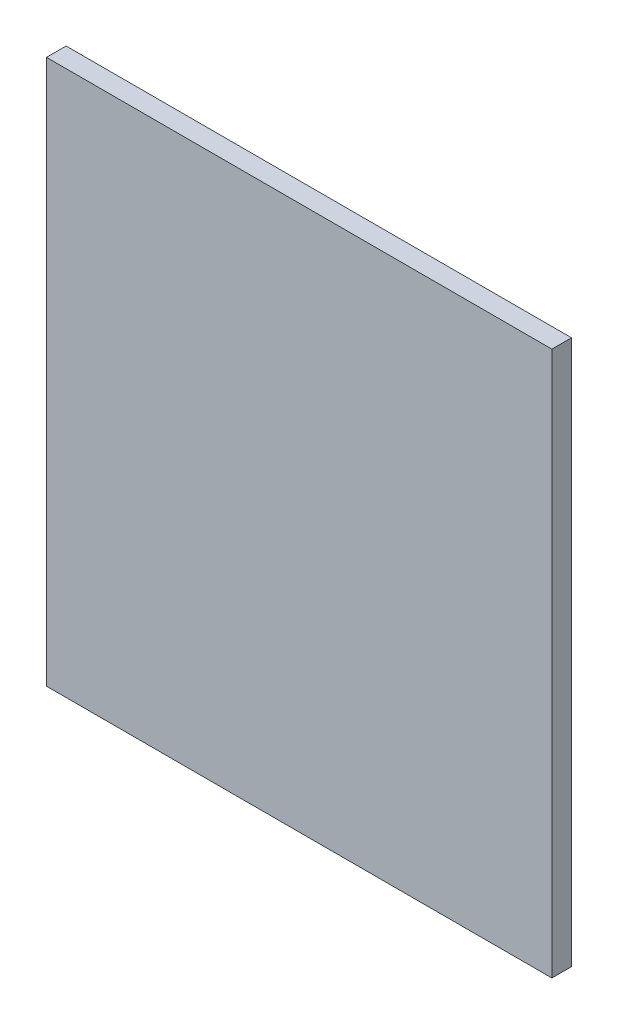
from build123d import *

# Parameters (mm, degrees)
SINGLE_COMMON_PLANE_Z0_START = -4
SKETCH_1_W                   = 103
SKETCH_1_H                   = 111
SINGLE_COMMON_PLANE_Z0_DEPTH = 4


with BuildPart() as part:
    # Sketch 1 → Single_common_plane_Z0 (new body)
    with BuildSketch(Plane.XY.offset(SINGLE_COMMON_PLANE_Z0_START)):
        with Locations((1.5, -5.5)):
            Rectangle(SKETCH_1_W, SKETCH_1_H)
    extrude(amount=SINGLE_COMMON_PLANE_Z0_DEPTH)


solid = part.part
